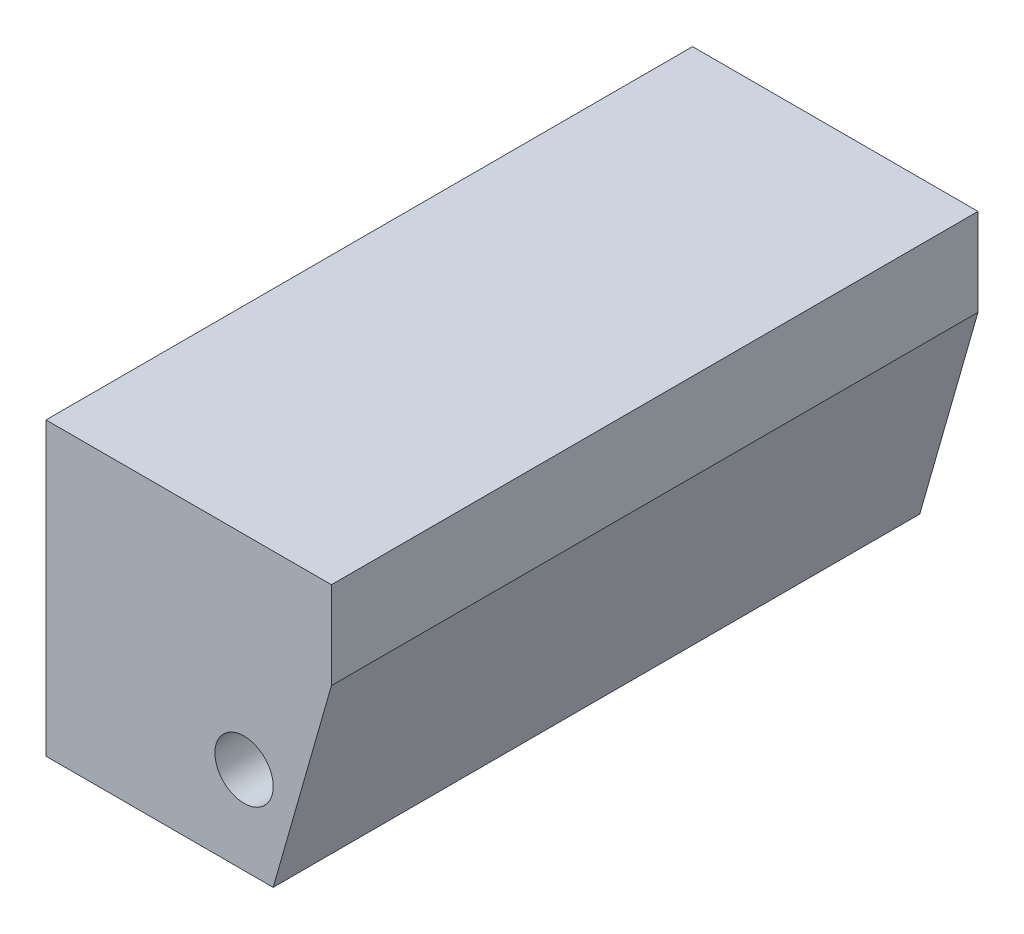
from build123d import *

# Parameters (mm, degrees)
SCHIZZO1_W                   = 49
SCHIZZO1_H                   = 111
ESTRUSIONE_ESTRUSIONE1_DEPTH = 50
TAGLIO_ESTRUSIONE1_DEPTH     = 125.5
SCHIZZO3_R                   = 5.005
TAGLIO_ESTRUSIONE2_DEPTH     = 125.5


with BuildPart() as part:
    # Schizzo1 → Estrusione-Estrusione1 (new body)
    with BuildSketch(Plane(origin=(0, 0, 0), x_dir=(1, 0, 0), z_dir=(0, 1, 0))):
        with Locations((24.5, 55.5)):
            Rectangle(SCHIZZO1_W, SCHIZZO1_H)
    extrude(amount=ESTRUSIONE_ESTRUSIONE1_DEPTH)

    # Schizzo2 → Taglio-Estrusione1 (cut)
    with BuildSketch(Plane.XY):
        Polygon((49, 35), (39, 0), (49, 0), align=None)
    extrude(amount=-TAGLIO_ESTRUSIONE1_DEPTH, mode=Mode.SUBTRACT)

    # Schizzo3 → Taglio-Estrusione2 (cut)
    with BuildSketch(Plane.XY):
        with Locations((34, 15)):
            Circle(SCHIZZO3_R)
    extrude(amount=-TAGLIO_ESTRUSIONE2_DEPTH, mode=Mode.SUBTRACT)


solid = part.part
